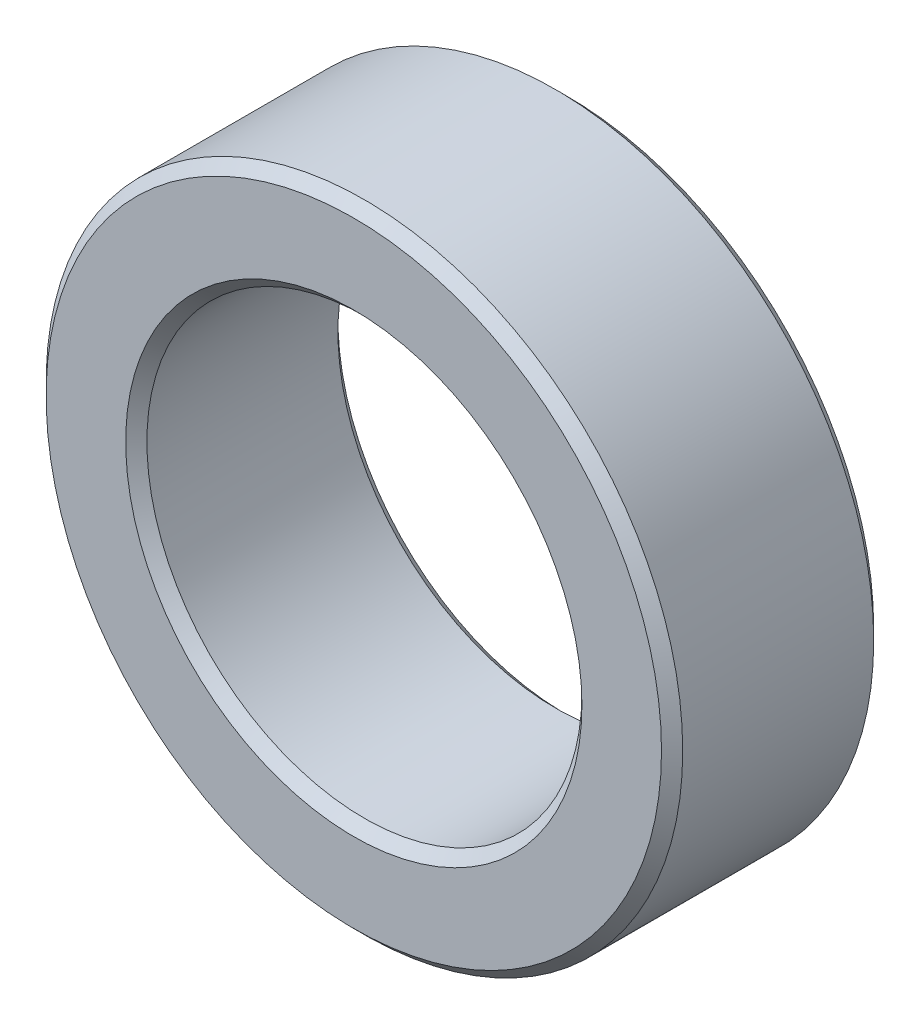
from build123d import *

# Parameters (mm, degrees)
SKETCH1_R           = 6
SKETCH1_R_2         = 4.1
BOSS_EXTRUDE2_DEPTH = 2
CHAMFER3_SIZE       = 0.2


with BuildPart() as part:
    # Sketch1 → Boss-Extrude2 (new, symmetric)
    with BuildSketch(Plane.XY):
        Circle(SKETCH1_R)
        Circle(SKETCH1_R_2, mode=Mode.SUBTRACT)
    extrude(amount=BOSS_EXTRUDE2_DEPTH, both=True)

    # Chamfer3
    chamfer3_edges = [part.edges().sort_by_distance(p)[0] for p in [
        (-6, 0, -2),
        (-6, 0, 2),
        (-4.1, 0, -2),
        (-4.1, 0, 2),
    ]]
    chamfer(chamfer3_edges, length=CHAMFER3_SIZE)


solid = part.part
